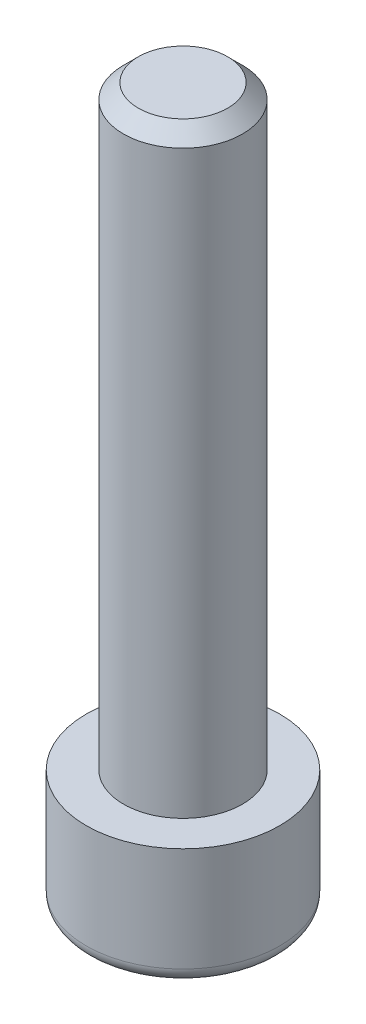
ISO-10303-21;
HEADER;
FILE_DESCRIPTION(('STEP AP214'),'2;1');
FILE_NAME('part.step','',(''),(''),'','','');
FILE_SCHEMA(('AUTOMOTIVE_DESIGN { 1 0 10303 214 1 1 1 1 }'));
ENDSEC;
DATA;
#1=APPLICATION_CONTEXT('core data for automotive mechanical design processes');
#2=APPLICATION_PROTOCOL_DEFINITION('international standard','automotive_design',2000,#1);
#3=PRODUCT_CONTEXT('',#1,'mechanical');
#4=PRODUCT('Part','Part','',(#3));
#5=PRODUCT_RELATED_PRODUCT_CATEGORY('part','',(#4));
#6=PRODUCT_DEFINITION_FORMATION('','',#4);
#7=PRODUCT_DEFINITION_CONTEXT('part definition',#1,'design');
#8=PRODUCT_DEFINITION('design','',#6,#7);
#9=PRODUCT_DEFINITION_SHAPE('','',#8);
#10=(LENGTH_UNIT() NAMED_UNIT(*) SI_UNIT(.MILLI.,.METRE.));
#11=(NAMED_UNIT(*) PLANE_ANGLE_UNIT() SI_UNIT($,.RADIAN.));
#12=(NAMED_UNIT(*) SI_UNIT($,.STERADIAN.) SOLID_ANGLE_UNIT());
#13=UNCERTAINTY_MEASURE_WITH_UNIT(LENGTH_MEASURE(1.E-05),#10,'distance_accuracy_value','');
#14=(GEOMETRIC_REPRESENTATION_CONTEXT(3) GLOBAL_UNCERTAINTY_ASSIGNED_CONTEXT((#13)) GLOBAL_UNIT_ASSIGNED_CONTEXT((#10,
#11,#12)) REPRESENTATION_CONTEXT('',''));
#15=CARTESIAN_POINT('',(0.,0.,0.));
#16=DIRECTION('',(0.,0.,1.));
#17=DIRECTION('',(1.,0.,0.));
#18=AXIS2_PLACEMENT_3D('',#15,#16,#17);
#19=CARTESIAN_POINT('',(0.,40.,0.));
#20=DIRECTION('',(0.,-1.,0.));
#21=DIRECTION('',(0.,0.,-1.));
#22=AXIS2_PLACEMENT_3D('',#19,#20,#21);
#23=CYLINDRICAL_SURFACE('',#22,4.);
#24=CARTESIAN_POINT('',(0.,39.,0.));
#25=DIRECTION('',(0.,1.,0.));
#26=DIRECTION('',(0.,0.,1.));
#27=AXIS2_PLACEMENT_3D('',#24,#25,#26);
#28=CIRCLE('',#27,4.);
#29=CARTESIAN_POINT('',(0.,39.,4.));
#30=VERTEX_POINT('',#29);
#31=EDGE_CURVE('E147',#30,#30,#28,.F.);
#32=ORIENTED_EDGE('',*,*,#31,.T.);
#33=EDGE_LOOP('',(#32));
#34=FACE_BOUND('',#33,.T.);
#35=CARTESIAN_POINT('',(0.,0.,0.));
#36=DIRECTION('',(0.,-1.,0.));
#37=DIRECTION('',(0.,0.,-1.));
#38=AXIS2_PLACEMENT_3D('',#35,#36,#37);
#39=CIRCLE('',#38,4.);
#40=CARTESIAN_POINT('',(0.,0.,-4.));
#41=VERTEX_POINT('',#40);
#42=EDGE_CURVE('E141',#41,#41,#39,.T.);
#43=ORIENTED_EDGE('',*,*,#42,.F.);
#44=EDGE_LOOP('',(#43));
#45=FACE_BOUND('',#44,.T.);
#46=ADVANCED_FACE('F30',(#34,#45),#23,.T.);
#47=CARTESIAN_POINT('',(0.,40.,0.));
#48=DIRECTION('',(0.,1.,0.));
#49=DIRECTION('',(0.,0.,1.));
#50=AXIS2_PLACEMENT_3D('',#47,#48,#49);
#51=PLANE('',#50);
#52=CARTESIAN_POINT('',(0.,40.,0.));
#53=DIRECTION('',(0.,1.,0.));
#54=DIRECTION('',(0.,0.,1.));
#55=AXIS2_PLACEMENT_3D('',#52,#53,#54);
#56=CIRCLE('',#55,3.00000000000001);
#57=CARTESIAN_POINT('',(0.,40.,3.00000000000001));
#58=VERTEX_POINT('',#57);
#59=EDGE_CURVE('E144',#58,#58,#56,.T.);
#60=ORIENTED_EDGE('',*,*,#59,.T.);
#61=EDGE_LOOP('',(#60));
#62=FACE_BOUND('',#61,.T.);
#63=ADVANCED_FACE('F168',(#62),#51,.T.);
#64=CARTESIAN_POINT('',(0.,40.,0.));
#65=DIRECTION('',(0.,-1.,0.));
#66=DIRECTION('',(0.,0.,-1.));
#67=AXIS2_PLACEMENT_3D('',#64,#65,#66);
#68=CONICAL_SURFACE('',#67,3.00000000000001,0.785398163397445);
#69=ORIENTED_EDGE('',*,*,#31,.F.);
#70=EDGE_LOOP('',(#69));
#71=FACE_BOUND('',#70,.T.);
#72=ORIENTED_EDGE('',*,*,#59,.F.);
#73=EDGE_LOOP('',(#72));
#74=FACE_BOUND('',#73,.T.);
#75=ADVANCED_FACE('F173',(#71,#74),#68,.T.);
#76=CARTESIAN_POINT('',(0.,0.,0.));
#77=DIRECTION('',(0.,-1.,0.));
#78=DIRECTION('',(0.,0.,-1.));
#79=AXIS2_PLACEMENT_3D('',#76,#77,#78);
#80=PLANE('',#79);
#81=CARTESIAN_POINT('',(0.,0.,0.));
#82=DIRECTION('',(0.,-1.,0.));
#83=DIRECTION('',(0.,0.,-1.));
#84=AXIS2_PLACEMENT_3D('',#81,#82,#83);
#85=CIRCLE('',#84,6.5);
#86=CARTESIAN_POINT('',(0.,0.,-6.5));
#87=VERTEX_POINT('',#86);
#88=EDGE_CURVE('E132',#87,#87,#85,.T.);
#89=ORIENTED_EDGE('',*,*,#88,.F.);
#90=EDGE_LOOP('',(#89));
#91=FACE_BOUND('',#90,.T.);
#92=ORIENTED_EDGE('',*,*,#42,.T.);
#93=EDGE_LOOP('',(#92));
#94=FACE_BOUND('',#93,.T.);
#95=ADVANCED_FACE('F179',(#91,#94),#80,.F.);
#96=CARTESIAN_POINT('',(0.,-8.,0.));
#97=DIRECTION('',(0.,1.,0.));
#98=DIRECTION('',(0.,0.,1.));
#99=AXIS2_PLACEMENT_3D('',#96,#97,#98);
#100=CYLINDRICAL_SURFACE('',#99,6.5);
#101=CARTESIAN_POINT('',(0.,-7.,0.));
#102=DIRECTION('',(0.,-1.,0.));
#103=DIRECTION('',(0.,0.,-1.));
#104=AXIS2_PLACEMENT_3D('',#101,#102,#103);
#105=CIRCLE('',#104,6.5);
#106=CARTESIAN_POINT('',(0.,-7.,-6.5));
#107=VERTEX_POINT('',#106);
#108=EDGE_CURVE('E11',#107,#107,#105,.F.);
#109=ORIENTED_EDGE('',*,*,#108,.T.);
#110=EDGE_LOOP('',(#109));
#111=FACE_BOUND('',#110,.T.);
#112=ORIENTED_EDGE('',*,*,#88,.T.);
#113=EDGE_LOOP('',(#112));
#114=FACE_BOUND('',#113,.T.);
#115=ADVANCED_FACE('F163',(#111,#114),#100,.T.);
#116=CARTESIAN_POINT('',(0.,-8.,0.));
#117=DIRECTION('',(0.,-1.,0.));
#118=DIRECTION('',(0.,0.,-1.));
#119=AXIS2_PLACEMENT_3D('',#116,#117,#118);
#120=PLANE('',#119);
#121=DIRECTION('',(-0.867435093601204,0.,0.497550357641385));
#122=VECTOR('',#121,1.);
#123=CARTESIAN_POINT('',(0.,-8.,3.45));
#124=LINE('',#123,#122);
#125=CARTESIAN_POINT('',(3.,-8.,1.72923600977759));
#126=VERTEX_POINT('',#125);
#127=CARTESIAN_POINT('',(0.,-8.,3.45));
#128=VERTEX_POINT('',#127);
#129=EDGE_CURVE('E44',#126,#128,#124,.T.);
#130=ORIENTED_EDGE('',*,*,#129,.F.);
#131=DIRECTION('',(0.,0.,1.));
#132=VECTOR('',#131,1.);
#133=CARTESIAN_POINT('',(3.,-8.,1.72923600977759));
#134=LINE('',#133,#132);
#135=CARTESIAN_POINT('',(3.,-8.,-1.72923600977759));
#136=VERTEX_POINT('',#135);
#137=EDGE_CURVE('E114',#136,#126,#134,.T.);
#138=ORIENTED_EDGE('',*,*,#137,.F.);
#139=DIRECTION('',(0.867435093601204,0.,0.497550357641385));
#140=VECTOR('',#139,1.);
#141=CARTESIAN_POINT('',(3.,-8.,-1.72923600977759));
#142=LINE('',#141,#140);
#143=CARTESIAN_POINT('',(0.,-8.,-3.45));
#144=VERTEX_POINT('',#143);
#145=EDGE_CURVE('E108',#144,#136,#142,.T.);
#146=ORIENTED_EDGE('',*,*,#145,.F.);
#147=DIRECTION('',(0.867435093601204,0.,-0.497550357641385));
#148=VECTOR('',#147,1.);
#149=CARTESIAN_POINT('',(0.,-8.,-3.45));
#150=LINE('',#149,#148);
#151=CARTESIAN_POINT('',(-3.,-8.,-1.72923600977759));
#152=VERTEX_POINT('',#151);
#153=EDGE_CURVE('E106',#152,#144,#150,.T.);
#154=ORIENTED_EDGE('',*,*,#153,.F.);
#155=DIRECTION('',(0.,0.,-1.));
#156=VECTOR('',#155,1.);
#157=CARTESIAN_POINT('',(-3.,-8.,-1.72923600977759));
#158=LINE('',#157,#156);
#159=CARTESIAN_POINT('',(-3.,-8.,1.72923600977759));
#160=VERTEX_POINT('',#159);
#161=EDGE_CURVE('E87',#160,#152,#158,.T.);
#162=ORIENTED_EDGE('',*,*,#161,.F.);
#163=DIRECTION('',(-0.867435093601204,0.,-0.497550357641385));
#164=VECTOR('',#163,1.);
#165=CARTESIAN_POINT('',(-3.,-8.,1.72923600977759));
#166=LINE('',#165,#164);
#167=EDGE_CURVE('E98',#128,#160,#166,.T.);
#168=ORIENTED_EDGE('',*,*,#167,.F.);
#169=EDGE_LOOP('',(#130,#138,#146,#154,#162,#168));
#170=FACE_BOUND('',#169,.T.);
#171=CARTESIAN_POINT('',(0.,-8.,0.));
#172=DIRECTION('',(0.,-1.,0.));
#173=DIRECTION('',(0.,0.,-1.));
#174=AXIS2_PLACEMENT_3D('',#171,#172,#173);
#175=CIRCLE('',#174,5.5);
#176=CARTESIAN_POINT('',(0.,-8.,-5.5));
#177=VERTEX_POINT('',#176);
#178=EDGE_CURVE('E37',#177,#177,#175,.T.);
#179=ORIENTED_EDGE('',*,*,#178,.T.);
#180=EDGE_LOOP('',(#179));
#181=FACE_BOUND('',#180,.T.);
#182=ADVANCED_FACE('F102',(#170,#181),#120,.T.);
#183=CARTESIAN_POINT('',(0.,-7.,0.));
#184=DIRECTION('',(0.,-1.,0.));
#185=DIRECTION('',(0.,0.,-1.));
#186=AXIS2_PLACEMENT_3D('',#183,#184,#185);
#187=TOROIDAL_SURFACE('',#186,5.5,1.);
#188=ORIENTED_EDGE('',*,*,#108,.F.);
#189=EDGE_LOOP('',(#188));
#190=FACE_BOUND('',#189,.T.);
#191=ORIENTED_EDGE('',*,*,#178,.F.);
#192=EDGE_LOOP('',(#191));
#193=FACE_BOUND('',#192,.T.);
#194=ADVANCED_FACE('F152',(#190,#193),#187,.T.);
#195=CARTESIAN_POINT('',(0.,-2.,3.45));
#196=DIRECTION('',(0.497550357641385,0.,0.867435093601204));
#197=DIRECTION('',(0.867435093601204,0.,-0.497550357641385));
#198=AXIS2_PLACEMENT_3D('',#195,#196,#197);
#199=PLANE('',#198);
#200=ORIENTED_EDGE('',*,*,#129,.T.);
#201=DIRECTION('',(0.,-1.,0.));
#202=VECTOR('',#201,1.);
#203=CARTESIAN_POINT('',(0.,-2.,3.45));
#204=LINE('',#203,#202);
#205=CARTESIAN_POINT('',(0.,-2.,3.45));
#206=VERTEX_POINT('',#205);
#207=EDGE_CURVE('E95',#206,#128,#204,.T.);
#208=ORIENTED_EDGE('',*,*,#207,.F.);
#209=DIRECTION('',(-0.867435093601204,0.,0.497550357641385));
#210=VECTOR('',#209,1.);
#211=CARTESIAN_POINT('',(0.,-2.,3.45));
#212=LINE('',#211,#210);
#213=CARTESIAN_POINT('',(3.,-2.,1.72923600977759));
#214=VERTEX_POINT('',#213);
#215=EDGE_CURVE('E116',#214,#206,#212,.T.);
#216=ORIENTED_EDGE('',*,*,#215,.F.);
#217=DIRECTION('',(0.,-1.,0.));
#218=VECTOR('',#217,1.);
#219=CARTESIAN_POINT('',(3.,-2.,1.72923600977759));
#220=LINE('',#219,#218);
#221=EDGE_CURVE('E51',#214,#126,#220,.T.);
#222=ORIENTED_EDGE('',*,*,#221,.T.);
#223=EDGE_LOOP('',(#200,#208,#216,#222));
#224=FACE_BOUND('',#223,.T.);
#225=ADVANCED_FACE('F154',(#224),#199,.F.);
#226=CARTESIAN_POINT('',(3.,-2.,1.72923600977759));
#227=DIRECTION('',(1.,0.,0.));
#228=DIRECTION('',(0.,0.,-1.));
#229=AXIS2_PLACEMENT_3D('',#226,#227,#228);
#230=PLANE('',#229);
#231=ORIENTED_EDGE('',*,*,#137,.T.);
#232=ORIENTED_EDGE('',*,*,#221,.F.);
#233=DIRECTION('',(0.,0.,1.));
#234=VECTOR('',#233,1.);
#235=CARTESIAN_POINT('',(3.,-2.,1.72923600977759));
#236=LINE('',#235,#234);
#237=CARTESIAN_POINT('',(3.,-2.,-1.72923600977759));
#238=VERTEX_POINT('',#237);
#239=EDGE_CURVE('E128',#238,#214,#236,.T.);
#240=ORIENTED_EDGE('',*,*,#239,.F.);
#241=DIRECTION('',(0.,-1.,0.));
#242=VECTOR('',#241,1.);
#243=CARTESIAN_POINT('',(3.,-2.,-1.72923600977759));
#244=LINE('',#243,#242);
#245=EDGE_CURVE('E133',#238,#136,#244,.T.);
#246=ORIENTED_EDGE('',*,*,#245,.T.);
#247=EDGE_LOOP('',(#231,#232,#240,#246));
#248=FACE_BOUND('',#247,.T.);
#249=ADVANCED_FACE('F161',(#248),#230,.F.);
#250=CARTESIAN_POINT('',(3.,-2.,-1.72923600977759));
#251=DIRECTION('',(0.497550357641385,0.,-0.867435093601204));
#252=DIRECTION('',(-0.867435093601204,0.,-0.497550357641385));
#253=AXIS2_PLACEMENT_3D('',#250,#251,#252);
#254=PLANE('',#253);
#255=ORIENTED_EDGE('',*,*,#145,.T.);
#256=ORIENTED_EDGE('',*,*,#245,.F.);
#257=DIRECTION('',(0.867435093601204,0.,0.497550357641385));
#258=VECTOR('',#257,1.);
#259=CARTESIAN_POINT('',(3.,-2.,-1.72923600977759));
#260=LINE('',#259,#258);
#261=CARTESIAN_POINT('',(0.,-2.,-3.45));
#262=VERTEX_POINT('',#261);
#263=EDGE_CURVE('E125',#262,#238,#260,.T.);
#264=ORIENTED_EDGE('',*,*,#263,.F.);
#265=DIRECTION('',(0.,-1.,0.));
#266=VECTOR('',#265,1.);
#267=CARTESIAN_POINT('',(0.,-2.,-3.45));
#268=LINE('',#267,#266);
#269=EDGE_CURVE('E135',#262,#144,#268,.T.);
#270=ORIENTED_EDGE('',*,*,#269,.T.);
#271=EDGE_LOOP('',(#255,#256,#264,#270));
#272=FACE_BOUND('',#271,.T.);
#273=ADVANCED_FACE('F239',(#272),#254,.F.);
#274=CARTESIAN_POINT('',(0.,-2.,-3.45));
#275=DIRECTION('',(-0.497550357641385,0.,-0.867435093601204));
#276=DIRECTION('',(-0.867435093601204,0.,0.497550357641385));
#277=AXIS2_PLACEMENT_3D('',#274,#275,#276);
#278=PLANE('',#277);
#279=ORIENTED_EDGE('',*,*,#153,.T.);
#280=ORIENTED_EDGE('',*,*,#269,.F.);
#281=DIRECTION('',(0.867435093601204,0.,-0.497550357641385));
#282=VECTOR('',#281,1.);
#283=CARTESIAN_POINT('',(0.,-2.,-3.45));
#284=LINE('',#283,#282);
#285=CARTESIAN_POINT('',(-3.,-2.,-1.72923600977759));
#286=VERTEX_POINT('',#285);
#287=EDGE_CURVE('E122',#286,#262,#284,.T.);
#288=ORIENTED_EDGE('',*,*,#287,.F.);
#289=DIRECTION('',(0.,-1.,0.));
#290=VECTOR('',#289,1.);
#291=CARTESIAN_POINT('',(-3.,-2.,-1.72923600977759));
#292=LINE('',#291,#290);
#293=EDGE_CURVE('E94',#286,#152,#292,.T.);
#294=ORIENTED_EDGE('',*,*,#293,.T.);
#295=EDGE_LOOP('',(#279,#280,#288,#294));
#296=FACE_BOUND('',#295,.T.);
#297=ADVANCED_FACE('F247',(#296),#278,.F.);
#298=CARTESIAN_POINT('',(-3.,-2.,-1.72923600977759));
#299=DIRECTION('',(-1.,0.,0.));
#300=DIRECTION('',(0.,0.,1.));
#301=AXIS2_PLACEMENT_3D('',#298,#299,#300);
#302=PLANE('',#301);
#303=ORIENTED_EDGE('',*,*,#161,.T.);
#304=ORIENTED_EDGE('',*,*,#293,.F.);
#305=DIRECTION('',(0.,0.,-1.));
#306=VECTOR('',#305,1.);
#307=CARTESIAN_POINT('',(-3.,-2.,-1.72923600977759));
#308=LINE('',#307,#306);
#309=CARTESIAN_POINT('',(-3.,-2.,1.72923600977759));
#310=VERTEX_POINT('',#309);
#311=EDGE_CURVE('E90',#310,#286,#308,.T.);
#312=ORIENTED_EDGE('',*,*,#311,.F.);
#313=DIRECTION('',(0.,-1.,0.));
#314=VECTOR('',#313,1.);
#315=CARTESIAN_POINT('',(-3.,-2.,1.72923600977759));
#316=LINE('',#315,#314);
#317=EDGE_CURVE('E83',#310,#160,#316,.T.);
#318=ORIENTED_EDGE('',*,*,#317,.T.);
#319=EDGE_LOOP('',(#303,#304,#312,#318));
#320=FACE_BOUND('',#319,.T.);
#321=ADVANCED_FACE('F85',(#320),#302,.F.);
#322=CARTESIAN_POINT('',(-3.,-2.,1.72923600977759));
#323=DIRECTION('',(-0.497550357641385,0.,0.867435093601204));
#324=DIRECTION('',(0.867435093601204,0.,0.497550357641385));
#325=AXIS2_PLACEMENT_3D('',#322,#323,#324);
#326=PLANE('',#325);
#327=ORIENTED_EDGE('',*,*,#167,.T.);
#328=ORIENTED_EDGE('',*,*,#317,.F.);
#329=DIRECTION('',(-0.867435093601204,0.,-0.497550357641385));
#330=VECTOR('',#329,1.);
#331=CARTESIAN_POINT('',(-3.,-2.,1.72923600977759));
#332=LINE('',#331,#330);
#333=EDGE_CURVE('E119',#206,#310,#332,.T.);
#334=ORIENTED_EDGE('',*,*,#333,.F.);
#335=ORIENTED_EDGE('',*,*,#207,.T.);
#336=EDGE_LOOP('',(#327,#328,#334,#335));
#337=FACE_BOUND('',#336,.T.);
#338=ADVANCED_FACE('F99',(#337),#326,.F.);
#339=CARTESIAN_POINT('',(3.,-2.,1.72923600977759));
#340=DIRECTION('',(0.,1.,0.));
#341=DIRECTION('',(0.,0.,1.));
#342=AXIS2_PLACEMENT_3D('',#339,#340,#341);
#343=PLANE('',#342);
#344=ORIENTED_EDGE('',*,*,#215,.T.);
#345=ORIENTED_EDGE('',*,*,#333,.T.);
#346=ORIENTED_EDGE('',*,*,#311,.T.);
#347=ORIENTED_EDGE('',*,*,#287,.T.);
#348=ORIENTED_EDGE('',*,*,#263,.T.);
#349=ORIENTED_EDGE('',*,*,#239,.T.);
#350=EDGE_LOOP('',(#344,#345,#346,#347,#348,#349));
#351=FACE_BOUND('',#350,.T.);
#352=ADVANCED_FACE('F271',(#351),#343,.F.);
#353=CLOSED_SHELL('',(#46,#63,#75,#95,#115,#182,#194,#225,#249,#273,#297,#321,#338,#352));
#354=MANIFOLD_SOLID_BREP('B2',#353);
#355=ADVANCED_BREP_SHAPE_REPRESENTATION('',(#18,#354),#14);
#356=SHAPE_DEFINITION_REPRESENTATION(#9,#355);
ENDSEC;
END-ISO-10303-21;
